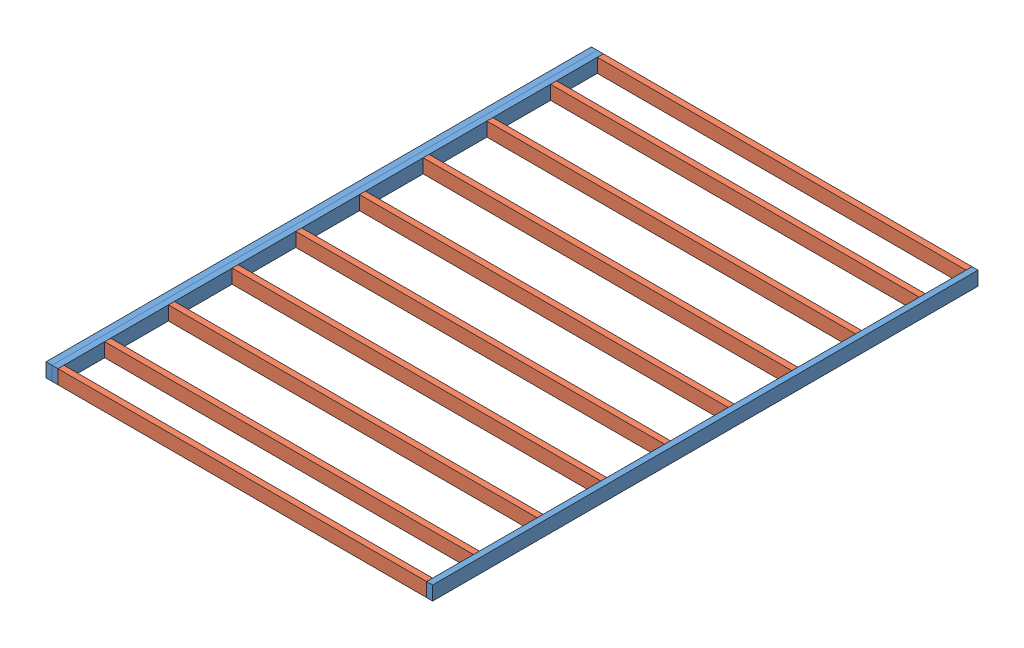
SolidWorks assembly DESN220-51C-MKrueger-Wall without window.SLDASM, configuration Default (file format 6000). Lengths in mm.
Overall size (2466.98 88.9 3479.8).
13 component instances, 2 part files, 30 mates.
Components (placement in the parent):
- DESN220-51C-MKrueger-2x4x137-3: DESN220-51C-MKrueger-2x4x137.SLDPRT [Default] at (0 88.9 0) x (0 1 0) z (0 0 1) size (88.9 38.1 3479.8)
- DESN220-51C-MKrueger-2x4 STUD-2: DESN220-51C-MKrueger-2x4 STUD.SLDPRT [Default] at (2352.675 0 0) x (0 -1 0) z (-1 0 0) size (88.9 38.1 2352.68)
- DESN220-51C-MKrueger-2x4x137-4: DESN220-51C-MKrueger-2x4x137.SLDPRT [Default] at (-76.2 0 0) x (0 -1 0) z (0 0 1) size (88.9 38.1 3479.8)
- DESN220-51C-MKrueger-2x4x137-5: DESN220-51C-MKrueger-2x4x137.SLDPRT [Default] at (2390.775 88.9 0) x (0 1 0) z (0 0 1) size (88.9 38.1 3479.8)
- DESN220-51C-MKrueger-2x4 STUD-3: DESN220-51C-MKrueger-2x4 STUD.SLDPRT [Default] at (2352.675 0 298.45) x (0 -1 0) z (-1 0 0) size (88.9 38.1 2352.68)
- DESN220-51C-MKrueger-2x4 STUD-5: DESN220-51C-MKrueger-2x4 STUD.SLDPRT [Default] at (0 0 742.95) x (0 -1 0) z (1 0 0) size (88.9 38.1 2352.68)
- DESN220-51C-MKrueger-2x4 STUD-6: DESN220-51C-MKrueger-2x4 STUD.SLDPRT [Default] at (0 0 1149.35) x (0 -1 0) z (1 0 0) size (88.9 38.1 2352.68)
- DESN220-51C-MKrueger-2x4 STUD-7: DESN220-51C-MKrueger-2x4 STUD.SLDPRT [Default] at (0 0 1555.75) x (0 -1 0) z (1 0 0) size (88.9 38.1 2352.68)
- DESN220-51C-MKrueger-2x4 STUD-8: DESN220-51C-MKrueger-2x4 STUD.SLDPRT [Default] at (0 0 2368.55) x (0 -1 0) z (1 0 0) size (88.9 38.1 2352.68)
- DESN220-51C-MKrueger-2x4 STUD-9: DESN220-51C-MKrueger-2x4 STUD.SLDPRT [Default] at (0 0 1962.15) x (0 -1 0) z (1 0 0) size (88.9 38.1 2352.68)
- DESN220-51C-MKrueger-2x4 STUD-10: DESN220-51C-MKrueger-2x4 STUD.SLDPRT [Default] at (0 0 3181.35) x (0 -1 0) z (1 0 0) size (88.9 38.1 2352.68)
- DESN220-51C-MKrueger-2x4 STUD-11: DESN220-51C-MKrueger-2x4 STUD.SLDPRT [Default] at (0 0 2774.95) x (0 -1 0) z (1 0 0) size (88.9 38.1 2352.68)
- DESN220-51C-MKrueger-2x4 STUD-12: DESN220-51C-MKrueger-2x4 STUD.SLDPRT [Default] at (2352.675 88.9 3479.8) x (0 1 0) z (-1 0 0) size (88.9 38.1 2352.68)
Mates (geometry in assembly coordinates):
- Parallel3: parallel anti-aligned: line of DESN220-51C-MKrueger-2x4x137-3 through (-38.1 0 3479.8) axis (0 1 0); line of assembly
- Coincident4: coincident aligned: line of DESN220-51C-MKrueger-2x4x137-3 through (0 0 0) axis (0 0 1); line of assembly
- Coincident5: coincident aligned: line of DESN220-51C-MKrueger-2x4x137-3 through (0 88.9 0) axis (0 -1 0); line of assembly
- Coincident9: coincident anti-aligned: line of DESN220-51C-MKrueger-2x4 STUD-2 through (0 0 0) axis (1 0 0); line of assembly
- Coincident10: coincident aligned: line of DESN220-51C-MKrueger-2x4 STUD-2 through (0 88.9 0) axis (0 -1 0); line of assembly
- Coincident11: coincident anti-aligned: line of DESN220-51C-MKrueger-2x4x137-3 through (-38.1 88.9 3479.8) axis (0 0 -1); line of DESN220-51C-MKrueger-2x4x137-4 through (-38.1 88.9 0) axis (0 0 1)
- Coincident12: coincident anti-aligned: line of DESN220-51C-MKrueger-2x4x137-3 through (-38.1 0 0) axis (0 0 1); line of DESN220-51C-MKrueger-2x4x137-4 through (-38.1 0 3479.8) axis (0 0 -1)
- Coincident13: coincident: moEndPointRef_w of DESN220-51C-MKrueger-2x4x137-3; moEndPointRef_w of DESN220-51C-MKrueger-2x4x137-4
- Coincident14: coincident: line of DESN220-51C-MKrueger-2x4 STUD-2 through (2352.675 0 38.1) axis (0 0 -1); plane of DESN220-51C-MKrueger-2x4x137-5 through (2352.675 88.9 0) normal (-1 0 0)
- Coincident15: coincident: moEndPointRef_w of DESN220-51C-MKrueger-2x4 STUD-2; line of DESN220-51C-MKrueger-2x4x137-5 through (2352.675 88.9 3479.8) axis (0 0 -1)
- Coincident16: coincident anti-aligned: line of DESN220-51C-MKrueger-2x4 STUD-2 through (2352.675 0 0) axis (0 1 0); line of DESN220-51C-MKrueger-2x4x137-5 through (2352.675 88.9 0) axis (0 -1 0)
- Coincident23: coincident: plane of DESN220-51C-MKrueger-2x4x137-5 through (2352.675 88.9 0) normal (-1 0 0); moEndPointRef_w of DESN220-51C-MKrueger-2x4 STUD-3
- Coincident25: coincident aligned: line of DESN220-51C-MKrueger-2x4x137-3 through (0 88.9 3479.8) axis (0 0 -1); line of DESN220-51C-MKrueger-2x4 STUD-3 through (0 88.9 336.55) axis (0 0 -1)
- Coincident26: coincident aligned: line of DESN220-51C-MKrueger-2x4 STUD-3 through (0 0 298.45) axis (1 0 0); line of assembly
- Coincident27: coincident anti-aligned: line of DESN220-51C-MKrueger-2x4 STUD-5 through (2352.675 0 704.85) axis (-1 0 0); line of assembly
- Coincident28: coincident: line of DESN220-51C-MKrueger-2x4x137-5 through (2352.675 88.9 3479.8) axis (0 0 -1); point of DESN220-51C-MKrueger-2x4 STUD-5
- Coincident29: coincident anti-aligned: line of DESN220-51C-MKrueger-2x4 STUD-6 through (2352.675 0 1111.25) axis (-1 0 0); line of assembly
- Coincident30: coincident anti-aligned: line of DESN220-51C-MKrueger-2x4x137-5 through (2352.675 88.9 3479.8) axis (0 0 -1); line of DESN220-51C-MKrueger-2x4 STUD-6 through (2352.675 88.9 1111.25) axis (0 0 1)
- Coincident31: coincident anti-aligned: line of DESN220-51C-MKrueger-2x4 STUD-7 through (2352.675 0 1517.65) axis (-1 0 0); line of assembly
- Coincident32: coincident anti-aligned: line of DESN220-51C-MKrueger-2x4x137-5 through (2352.675 88.9 3479.8) axis (0 0 -1); line of DESN220-51C-MKrueger-2x4 STUD-7 through (2352.675 88.9 1517.65) axis (0 0 1)
- Coincident33: coincident anti-aligned: line of DESN220-51C-MKrueger-2x4 STUD-9 through (2352.675 0 1924.05) axis (-1 0 0); line of assembly
- Coincident34: coincident anti-aligned: line of DESN220-51C-MKrueger-2x4x137-5 through (2352.675 88.9 3479.8) axis (0 0 -1); line of DESN220-51C-MKrueger-2x4 STUD-9 through (2352.675 88.9 1924.05) axis (0 0 1)
- Coincident35: coincident anti-aligned: line of DESN220-51C-MKrueger-2x4 STUD-8 through (2352.675 0 2330.45) axis (-1 0 0); line of assembly
- Coincident36: coincident: line of DESN220-51C-MKrueger-2x4x137-5 through (2352.675 88.9 3479.8) axis (0 0 -1); moEndPointRef_w of DESN220-51C-MKrueger-2x4 STUD-8
- Coincident37: coincident anti-aligned: line of DESN220-51C-MKrueger-2x4 STUD-11 through (2352.675 0 2736.85) axis (-1 0 0); line of assembly
- Coincident46: coincident: line of DESN220-51C-MKrueger-2x4x137-5 through (2352.675 88.9 3479.8) axis (0 0 -1); moEndPointRef_w of DESN220-51C-MKrueger-2x4 STUD-12
- Coincident47: coincident aligned: line of DESN220-51C-MKrueger-2x4 STUD-12 through (2352.675 0 3479.8) axis (-1 0 0); line of assembly
- Coincident49: coincident: line of DESN220-51C-MKrueger-2x4x137-5 through (2352.675 88.9 3479.8) axis (0 0 -1); point of DESN220-51C-MKrueger-2x4 STUD-11
- Coincident50: coincident anti-aligned: line of DESN220-51C-MKrueger-2x4x137-5 through (2352.675 88.9 3479.8) axis (0 0 -1); line of DESN220-51C-MKrueger-2x4 STUD-10 through (2352.675 88.9 3143.25) axis (0 0 1)
- Coincident51: coincident: plane of DESN220-51C-MKrueger-2x4 STUD-10 through (0 0 3143.25) normal (0 0 -1); line of assembly
